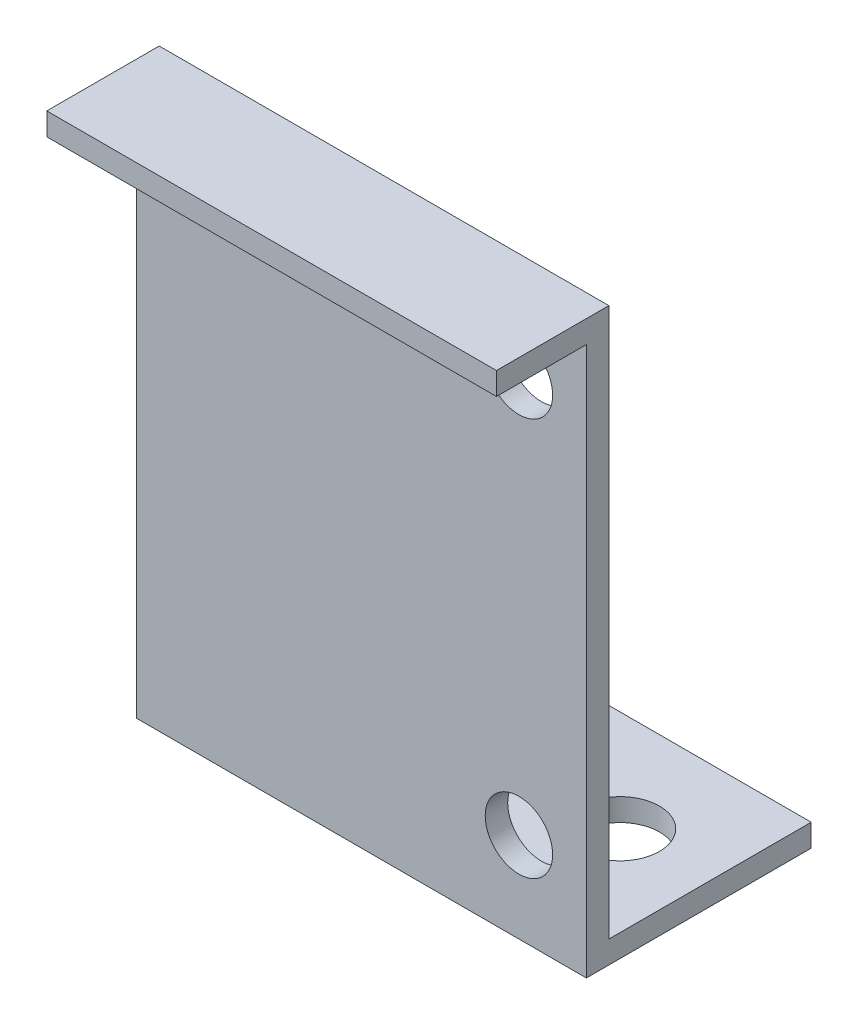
from build123d import *

# Parameters (mm, degrees)
EXTRUDE1_DEPTH = 20
SKETCH2_R      = 1.75
EXTRUDE2_DEPTH = 20
SKETCH3_R      = 1.5
EXTRUDE3_DEPTH = 20


with BuildPart() as part:
    # Sketch1 → Extrude1 (new body)
    with BuildSketch(Plane(origin=(0, 0, 0), x_dir=(0, 0, -1), z_dir=(1, 0, 0))):
        Polygon((10, 0), (0, 0), (0, 24.4), (-4, 24.4), (-4, 25.4), (1, 25.4), (1, 1), (10, 1), align=None)
    extrude(amount=EXTRUDE1_DEPTH)

    # Sketch2 → Extrude2 (cut)
    with BuildSketch(Plane(origin=(0, 1, 0), x_dir=(1, 0, 0), z_dir=(0, 1, 0))):
        with Locations(Location((4, 5.5, 0), (0, 0, 270))):
            Circle(SKETCH2_R)
        with Locations(Location((16, 5.5, 0), (0, 0, 270))):
            Circle(SKETCH2_R)
    extrude(amount=-EXTRUDE2_DEPTH, mode=Mode.SUBTRACT)

    # Sketch3 → Extrude3 (cut)
    with BuildSketch(Plane(origin=(0, 0, -1), x_dir=(-1, 0, 0), z_dir=(0, 0, -1))):
        with Locations((-17, 21.7)):
            Circle(SKETCH3_R)
        with Locations((-17, 4)):
            Circle(SKETCH3_R)
    extrude(amount=-EXTRUDE3_DEPTH, mode=Mode.SUBTRACT)


solid = part.part
